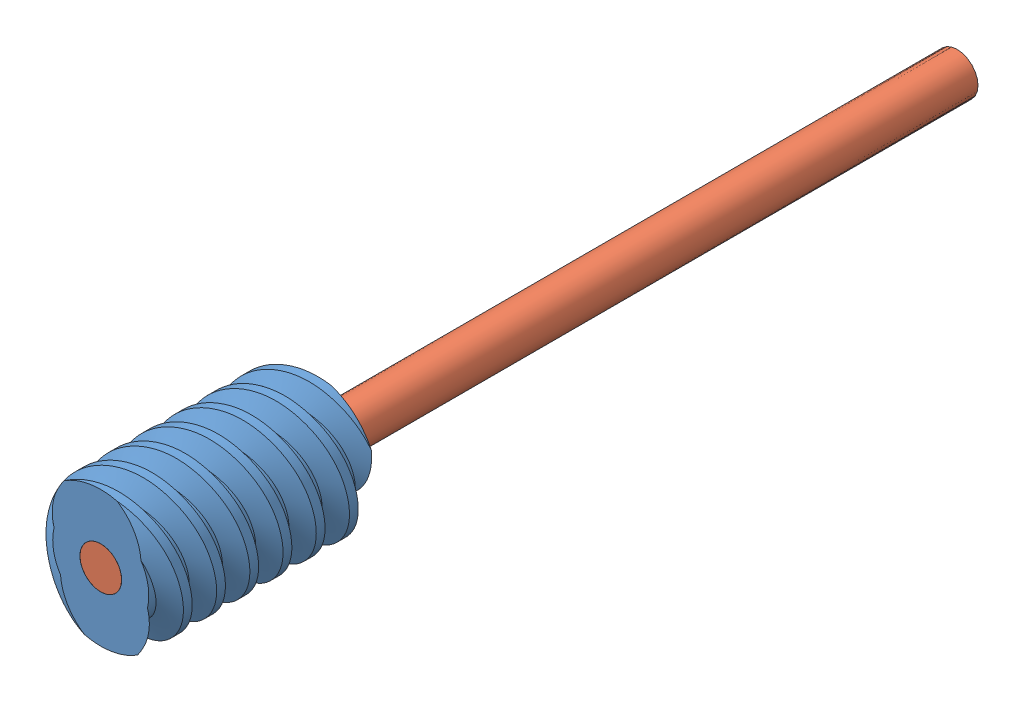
SolidWorks assembly axe moteur.SLDASM, configuration Default (file format 14000). Lengths in mm.
Overall size (7.25 7.25 41.45).
2 component instances, 2 part files, 2 mates.
Components (placement in the parent):
- vis sans fin-1: vis sans fin.SLDPRT [Default] at (-0.6642 1.5185 -0.6811) size (7.25 7.25 10.89)
- axe moteur-1: axe moteur.SLDPRT [Default] at (-0.6642 1.5185 -31.6811) size (2 2 41)
Mates (geometry in assembly coordinates):
- Coaxiale1: concentric anti-aligned: cylinder of vis sans fin-1 through (-0.6642 1.5185 -1.1269) axis (0 0 1) radius 1; cylinder of axe moteur-1 through (-0.6642 1.5185 9.3189) axis (0 0 -1) radius 1
- Coïncidente1: coincident aligned: plane of vis sans fin-1 through (-0.6642 1.5185 9.3189) normal (0 0 1); plane of axe moteur-1 through (-0.6642 1.5185 9.3189) normal (0 0 1)
